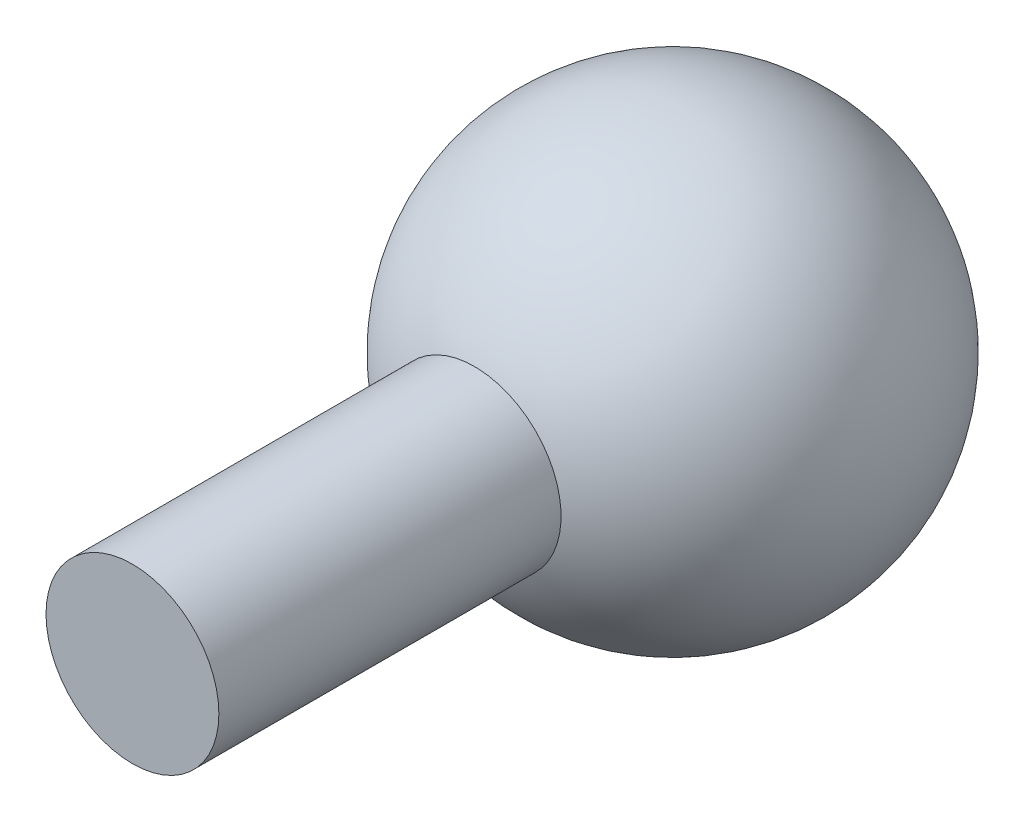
from build123d import *

# Parameters (mm, degrees)
ESQUISSE2_R      = 4
EXTRUSION1_DEPTH = 25


with BuildPart() as part:
    # Esquisse1 → R_volution2 (revolve)
    with BuildSketch(Plane.XY):
        with BuildLine():
            Line((0, 10), (0, -10))
            ThreePointArc((0, -10), (-10, 0), (0, 10))
        make_face()
    revolve(axis=Axis((0, 19.382223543, 0), (0, -1, 0)))

    # Esquisse2 → Extrusion1 (add)
    with BuildSketch(Plane.XY):
        with Locations(Location((0, 0, 0), (0, 0, 180))):
            Circle(ESQUISSE2_R)
    extrude(amount=EXTRUSION1_DEPTH)


solid = part.part
